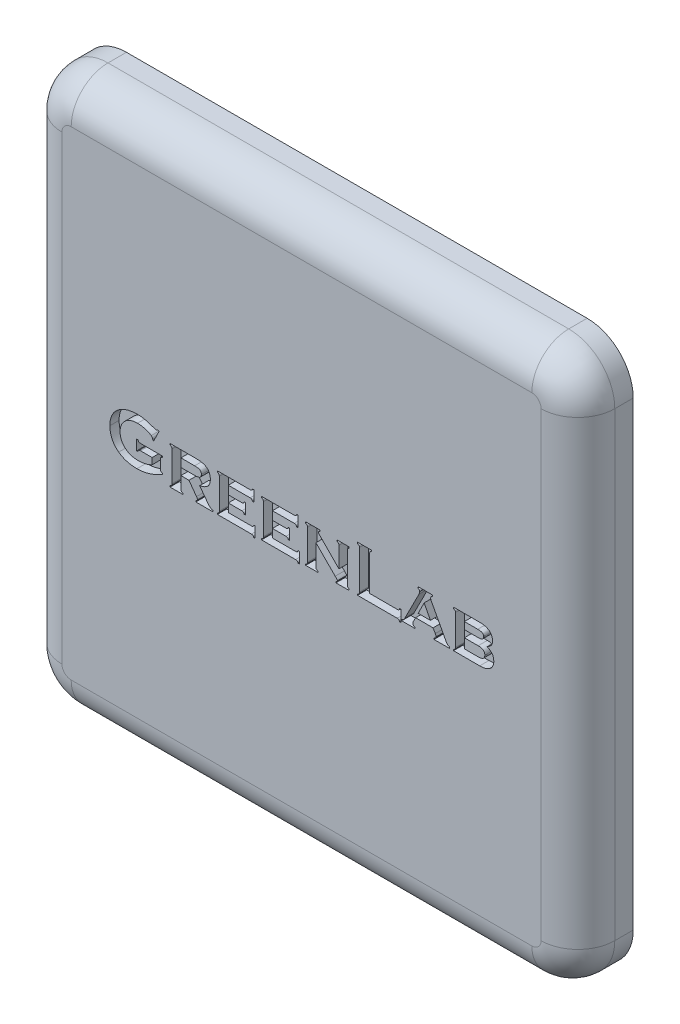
from build123d import *

# Parameters (mm, degrees)
SKETCH1_W           = 30.000000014
SKETCH1_H           = 30
BOSS_EXTRUDE1_DEPTH = 3
CUT_EXTRUDE1_START  = 1.500002
CUT_EXTRUDE1_DEPTH  = 0.5
BOSS_EXTRUDE2_START = 1.500028
BOSS_EXTRUDE2_DEPTH = 0.5
CUT_EXTRUDE2_START  = 1.500002
CUT_EXTRUDE2_DEPTH  = 0.5
BOSS_EXTRUDE3_START = 1.500028
BOSS_EXTRUDE3_DEPTH = 0.5
BOSS_EXTRUDE4_START = 1.500028
BOSS_EXTRUDE4_DEPTH = 0.5
CUT_EXTRUDE3_START  = 1.500002
CUT_EXTRUDE3_DEPTH  = 0.5
BOSS_EXTRUDE5_DEPTH = 0.5
CUT_EXTRUDE4_START  = 1.500002
CUT_EXTRUDE4_DEPTH  = 0.5
CUT_EXTRUDE5_START  = 1.500002
CUT_EXTRUDE5_DEPTH  = 0.5
CUT_EXTRUDE6_START  = 1.500002
CUT_EXTRUDE6_DEPTH  = 0.5
CUT_EXTRUDE7_START  = 1.500002
CUT_EXTRUDE7_DEPTH  = 0.5
CUT_EXTRUDE8_START  = 1.500002
CUT_EXTRUDE8_DEPTH  = 0.5
FILLET1_R           = 2.5
CHAMFER1_SIZE       = 0.091083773
CHAMFER1_SIZE2      = 0.082983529
FILLET2_R           = 2


with BuildPart() as part:
    # Sketch1 → Boss-Extrude1 (new body)
    with BuildSketch(Plane.XY.offset(3)):
        with Locations((-1.618e-06, -7.026e-06)):
            Rectangle(SKETCH1_W, SKETCH1_H)
    extrude(amount=-BOSS_EXTRUDE1_DEPTH)

    # Sketch2 → Cut-Extrude1 (cut)
    with BuildSketch(Plane.XY.offset(1.499998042).offset(CUT_EXTRUDE1_START)):
        with BuildLine():
            Line((-6.106229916, -0.416673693), (-6.545140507, -0.416673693))
            Line((-6.545140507, -0.416673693), (-6.545140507, -1.04818411))
            add(Edge.make_bspline(
                [(-6.545140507, -1.04818411), (-6.544473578, -1.060603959), (-6.543153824, -1.085181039), (-6.532801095, -1.121328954), (-6.507855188, -1.149496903), (-6.475690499, -1.16787463), (-6.452593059, -1.176316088), (-6.44097384, -1.180562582)],
                knots=[0, 0, 0, 0, 0.202843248, 0.401397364, 0.599300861, 0.798427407, 1, 1, 1, 1], degree=3))
            Line((-6.44097384, -1.180562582), (-6.44097384, -1.250007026))
            Line((-6.44097384, -1.250007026), (-7.135418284, -1.250007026))
            Line((-7.135418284, -1.250007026), (-7.135418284, -1.180562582))
            add(Edge.make_bspline(
                [(-7.135418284, -1.180562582), (-7.130522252, -1.178974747), (-7.120744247, -1.175803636), (-7.106322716, -1.170358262), (-7.092284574, -1.163918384), (-7.078939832, -1.156072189), (-7.066583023, -1.146684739), (-7.055763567, -1.135492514), (-7.047211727, -1.122492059), (-7.040637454, -1.108395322), (-7.036048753, -1.093589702), (-7.033207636, -1.078398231), (-7.03178077, -1.063051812), (-7.031428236, -1.052785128), (-7.031251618, -1.047641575)],
                knots=[0, 0, 0, 0, 0.083297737, 0.166356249, 0.249358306, 0.332965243, 0.416396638, 0.499814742, 0.583578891, 0.667019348, 0.750799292, 0.833751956, 0.916710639, 1, 1, 1, 1], degree=3))
            Line((-7.031251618, -1.047641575), (-7.031251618, 0.596238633))
            add(Edge.make_bspline(
                [(-7.031251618, 0.596238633), (-7.031467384, 0.600353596), (-7.031898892, 0.608583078), (-7.032933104, 0.620897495), (-7.034549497, 0.633124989), (-7.037009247, 0.645192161), (-7.040583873, 0.657001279), (-7.045537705, 0.6683115), (-7.052060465, 0.678837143), (-7.060155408, 0.688179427), (-7.06931687, 0.696458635), (-7.079323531, 0.703687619), (-7.08993715, 0.70999005), (-7.100985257, 0.715524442), (-7.112311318, 0.720451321), (-7.12380851, 0.72495007), (-7.13154719, 0.727756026), (-7.135418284, 0.72915964)],
                knots=[0, 0, 0, 0, 0.066822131, 0.133637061, 0.200355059, 0.266731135, 0.333141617, 0.400074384, 0.46641019, 0.533136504, 0.59984666, 0.666249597, 0.732989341, 0.799816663, 0.86650918, 0.933224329, 1, 1, 1, 1], degree=3))
            Line((-7.135418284, 0.72915964), (-7.135418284, 0.798604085))
            Line((-7.135418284, 0.798604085), (-5.805123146, 0.798604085))
            add(Edge.make_bspline(
                [(-5.805123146, 0.798604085), (-5.780616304, 0.798398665), (-5.731604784, 0.797987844), (-5.658099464, 0.79625398), (-5.584668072, 0.79279606), (-5.511415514, 0.786807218), (-5.438512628, 0.777768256), (-5.366729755, 0.763434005), (-5.296835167, 0.742622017), (-5.230115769, 0.713216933), (-5.18816938, 0.688797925), (-5.167102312, 0.676533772)],
                knots=[0, 0, 0, 0, 0.111579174, 0.2231485, 0.334733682, 0.44622071, 0.557706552, 0.669006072, 0.77912384, 0.889067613, 1, 1, 1, 1], degree=3))
            add(Edge.make_bspline(
                [(-5.167102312, 0.676533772), (-5.154763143, 0.66765202), (-5.130142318, 0.649929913), (-5.095666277, 0.620411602), (-5.064773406, 0.587391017), (-5.037991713, 0.550979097), (-5.014575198, 0.512301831), (-4.995017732, 0.471608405), (-4.979345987, 0.42947392), (-4.967058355, 0.38619193), (-4.957797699, 0.341995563), (-4.951967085, 0.297103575), (-4.949034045, 0.251930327), (-4.948290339, 0.221781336), (-4.947918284, 0.206698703)],
                knots=[0, 0, 0, 0, 0.084133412, 0.167874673, 0.250784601, 0.333836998, 0.417619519, 0.500718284, 0.583354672, 0.666147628, 0.749546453, 0.833074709, 0.916492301, 1, 1, 1, 1], degree=3))
            add(Edge.make_bspline(
                [(-4.947918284, 0.206698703), (-4.948580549, 0.186272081), (-4.94990496, 0.145422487), (-4.956712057, 0.084552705), (-4.968863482, 0.024592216), (-4.988036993, -0.033507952), (-5.014660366, -0.088462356), (-5.048214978, -0.139480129), (-5.08824372, -0.185602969), (-5.13444651, -0.225617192), (-5.184895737, -0.260069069), (-5.238383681, -0.289412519), (-5.293972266, -0.314301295), (-5.350882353, -0.335383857), (-5.408813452, -0.353220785), (-5.467509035, -0.368654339), (-5.50702161, -0.377515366), (-5.526802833, -0.381951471)],
                knots=[0, 0, 0, 0, 0.067093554, 0.134175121, 0.200873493, 0.267648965, 0.334524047, 0.400802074, 0.46761456, 0.53439703, 0.600932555, 0.66786926, 0.734464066, 0.800760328, 0.867034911, 0.933433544, 1, 1, 1, 1], degree=3))
            Line((-5.526802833, -0.381951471), (-5.129667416, -0.917433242))
            add(Edge.make_bspline(
                [(-5.129667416, -0.917433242), (-5.120118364, -0.930022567), (-5.101022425, -0.955198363), (-5.071770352, -0.992497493), (-5.041548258, -1.02901179), (-5.009934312, -1.064250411), (-4.976745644, -1.097946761), (-4.940268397, -1.128356), (-4.89926293, -1.152317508), (-4.855123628, -1.169942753), (-4.824422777, -1.177016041), (-4.809029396, -1.180562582)],
                knots=[0, 0, 0, 0, 0.111279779, 0.222534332, 0.333806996, 0.445027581, 0.555841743, 0.666724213, 0.778367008, 0.888873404, 1, 1, 1, 1], degree=3))
            Line((-4.809029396, -1.180562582), (-4.809029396, -1.250007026))
            Line((-4.809029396, -1.250007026), (-5.734051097, -1.250007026))
            Line((-5.734051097, -1.250007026), (-5.734051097, -1.180562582))
            add(Edge.make_bspline(
                [(-5.634767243, -1.101352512), (-5.635413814, -1.107068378), (-5.636702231, -1.118458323), (-5.64413306, -1.134429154), (-5.656852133, -1.146184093), (-5.670668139, -1.156288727), (-5.68567613, -1.164514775), (-5.701426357, -1.171013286), (-5.717639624, -1.176112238), (-5.728575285, -1.179077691), (-5.734051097, -1.180562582)],
                knots=[0, 0, 0, 0, 0.12593126, 0.250941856, 0.37645201, 0.501677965, 0.626962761, 0.751124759, 0.875380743, 1, 1, 1, 1], degree=3))
            add(Edge.make_bspline(
                [(-5.634767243, -1.101352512), (-5.635306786, -1.09758374), (-5.636383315, -1.090064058), (-5.639130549, -1.07903861), (-5.64269468, -1.068328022), (-5.647160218, -1.057983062), (-5.652606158, -1.048109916), (-5.658252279, -1.038321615), (-5.664206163, -1.028695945), (-5.670449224, -1.019251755), (-5.677004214, -1.010019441), (-5.683781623, -1.000946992), (-5.690705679, -0.991985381), (-5.695369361, -0.98604848), (-5.697701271, -0.983079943)],
                knots=[0, 0, 0, 0, 0.084082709, 0.167766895, 0.250652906, 0.333309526, 0.416319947, 0.499639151, 0.583018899, 0.666366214, 0.749761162, 0.833176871, 0.916585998, 1, 1, 1, 1], degree=3))
            Line((-5.697701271, -0.983079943), (-6.106229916, -0.416673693))
        make_face()
    extrude(amount=-CUT_EXTRUDE1_DEPTH, mode=Mode.SUBTRACT)

    # Sketch3 → Boss-Extrude2 (add)
    with BuildSketch(Plane.YX.offset(-4.000027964).offset(BOSS_EXTRUDE2_START)):
        with BuildLine():
            Line((0.41665964, -5.799697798), (0.41665964, -6.545140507))
            Line((0.41665964, -6.545140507), (-0.034729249, -6.545140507))
            Line((-0.034729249, -6.545140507), (-0.034729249, -5.799697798))
            add(Edge.make_bspline(
                [(-0.034729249, -5.799697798), (-0.034616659, -5.790245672), (-0.034391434, -5.771337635), (-0.033556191, -5.742985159), (-0.032101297, -5.714660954), (-0.029804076, -5.686388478), (-0.026462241, -5.658207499), (-0.022514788, -5.630104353), (-0.017106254, -5.602223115), (-0.00881011, -5.575071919), (-0.002219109, -5.557363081), (0.001078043, -5.548504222)],
                knots=[0, 0, 0, 0, 0.111096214, 0.222236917, 0.333344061, 0.444393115, 0.555543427, 0.666816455, 0.777923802, 0.88890622, 1, 1, 1, 1], degree=3))
            add(Edge.make_bspline(
                [(0.001078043, -5.548504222), (0.0061108, -5.538390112), (0.016141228, -5.518232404), (0.035981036, -5.490622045), (0.061759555, -5.468438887), (0.091459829, -5.452042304), (0.123658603, -5.441457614), (0.157052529, -5.43551634), (0.179643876, -5.434525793), (0.190965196, -5.434029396)],
                knots=[0, 0, 0, 0, 0.143264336, 0.285529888, 0.428089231, 0.571057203, 0.713277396, 0.856313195, 1, 1, 1, 1], degree=3))
            add(Edge.make_bspline(
                [(0.190965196, -5.434029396), (0.214569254, -5.435395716), (0.261502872, -5.438112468), (0.32888822, -5.464931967), (0.375464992, -5.52083735), (0.397961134, -5.588199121), (0.411028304, -5.657820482), (0.416265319, -5.728642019), (0.416528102, -5.775994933), (0.41665964, -5.799697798)],
                knots=[0, 0, 0, 0, 0.143321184, 0.284975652, 0.426217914, 0.569421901, 0.712368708, 0.856023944, 1, 1, 1, 1], degree=3))
        make_face()
    extrude(amount=-BOSS_EXTRUDE2_DEPTH)

    # Sketch4 → Cut-Extrude2 (cut)
    with BuildSketch(Plane.XY.offset(1.499998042).offset(CUT_EXTRUDE2_START)):
        with BuildLine():
            Line((9.670679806, -1.250007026), (8.24652616, -1.250007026))
            Line((8.24652616, -1.250007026), (8.24652616, -1.180562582))
            add(Edge.make_bspline(
                [(8.24652616, -1.180562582), (8.251422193, -1.178974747), (8.261200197, -1.175803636), (8.275621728, -1.170358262), (8.28965987, -1.163918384), (8.303004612, -1.156072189), (8.315361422, -1.146684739), (8.326180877, -1.135492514), (8.334732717, -1.122492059), (8.34130699, -1.108395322), (8.345895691, -1.093589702), (8.348736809, -1.078398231), (8.350163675, -1.063051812), (8.350516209, -1.052785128), (8.350692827, -1.047641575)],
                knots=[0, 0, 0, 0, 0.083297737, 0.166356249, 0.249358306, 0.332965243, 0.416396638, 0.499814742, 0.583578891, 0.667019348, 0.750799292, 0.833751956, 0.916710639, 1, 1, 1, 1], degree=3))
            Line((8.350692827, -1.047641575), (8.350692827, 0.596238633))
            add(Edge.make_bspline(
                [(8.350692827, 0.596238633), (8.349982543, 0.608502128), (8.348574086, 0.632820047), (8.338878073, 0.668917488), (8.314230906, 0.69762551), (8.281675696, 0.716208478), (8.258296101, 0.7248229), (8.24652616, 0.72915964)],
                knots=[0, 0, 0, 0, 0.199879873, 0.396352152, 0.595025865, 0.796124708, 1, 1, 1, 1], degree=3))
            Line((8.24652616, 0.72915964), (8.24652616, 0.798604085))
            Line((8.24652616, 0.798604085), (9.644095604, 0.798604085))
            add(Edge.make_bspline(
                [(9.644095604, 0.798604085), (9.671083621, 0.79807869), (9.725041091, 0.797028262), (9.805785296, 0.791621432), (9.886028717, 0.78168197), (9.965359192, 0.765710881), (10.042269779, 0.741216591), (10.116327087, 0.708558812), (10.160631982, 0.678188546), (10.182832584, 0.662970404)],
                knots=[0, 0, 0, 0, 0.14329605, 0.286493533, 0.429411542, 0.572336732, 0.715373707, 0.8573775, 1, 1, 1, 1], degree=3))
            add(Edge.make_bspline(
                [(10.182832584, 0.662970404), (10.195562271, 0.652165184), (10.2210203, 0.630555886), (10.255977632, 0.594603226), (10.285772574, 0.554483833), (10.311146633, 0.511566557), (10.331826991, 0.466181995), (10.346757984, 0.418663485), (10.356726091, 0.370070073), (10.36273618, 0.320860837), (10.36396532, 0.287826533), (10.364581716, 0.271260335)],
                knots=[0, 0, 0, 0, 0.11182405, 0.223636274, 0.335033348, 0.445742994, 0.557092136, 0.668347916, 0.778631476, 0.888987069, 1, 1, 1, 1], degree=3))
            add(Edge.make_bspline(
                [(10.364581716, 0.271260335), (10.363540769, 0.245367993), (10.361459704, 0.193603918), (10.344821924, 0.117403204), (10.312778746, 0.04597875), (10.263871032, -0.014964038), (10.205382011, -0.066361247), (10.141146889, -0.110402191), (10.096272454, -0.136611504), (10.073783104, -0.14974661)],
                knots=[0, 0, 0, 0, 0.142850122, 0.285586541, 0.42774764, 0.570823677, 0.713189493, 0.856261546, 1, 1, 1, 1], degree=3))
            add(Edge.make_bspline(
                [(10.073783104, -0.14974661), (10.08261312, -0.153925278), (10.100270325, -0.162281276), (10.126580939, -0.1751736), (10.152636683, -0.188573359), (10.178326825, -0.202686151), (10.203522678, -0.217682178), (10.227974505, -0.233882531), (10.251669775, -0.251155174), (10.274675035, -0.269352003), (10.289401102, -0.282207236), (10.296764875, -0.288635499)],
                knots=[0, 0, 0, 0, 0.111096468, 0.222157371, 0.333196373, 0.444276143, 0.555455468, 0.666550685, 0.777717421, 0.888847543, 1, 1, 1, 1], degree=3))
            add(Edge.make_bspline(
                [(10.296764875, -0.288635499), (10.306821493, -0.299119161), (10.326895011, -0.320045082), (10.354038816, -0.354237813), (10.376527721, -0.391586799), (10.395605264, -0.430654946), (10.410283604, -0.471439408), (10.420963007, -0.513457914), (10.428150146, -0.556371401), (10.432528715, -0.599814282), (10.433526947, -0.628905), (10.43402616, -0.643453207)],
                knots=[0, 0, 0, 0, 0.111353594, 0.222267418, 0.333844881, 0.444931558, 0.55511502, 0.665519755, 0.776881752, 0.88841903, 1, 1, 1, 1], degree=3))
            add(Edge.make_bspline(
                [(10.43402616, -0.643453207), (10.43343277, -0.663162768), (10.43224984, -0.702454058), (10.425947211, -0.761136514), (10.413178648, -0.818817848), (10.39460022, -0.875097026), (10.369704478, -0.929004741), (10.338767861, -0.979775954), (10.301936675, -1.026590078), (10.25924822, -1.068396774), (10.228206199, -1.093253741), (10.212671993, -1.10569279)],
                knots=[0, 0, 0, 0, 0.110911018, 0.221102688, 0.331445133, 0.442621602, 0.553891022, 0.66473059, 0.776355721, 0.888082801, 1, 1, 1, 1], degree=3))
            add(Edge.make_bspline(
                [(10.212671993, -1.10569279), (10.189966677, -1.12053216), (10.144717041, -1.15010568), (10.071154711, -1.184905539), (9.99400232, -1.210563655), (9.914783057, -1.230034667), (9.833929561, -1.241971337), (9.752439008, -1.248378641), (9.697942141, -1.249464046), (9.670679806, -1.250007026)],
                knots=[0, 0, 0, 0, 0.142651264, 0.284291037, 0.426813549, 0.570029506, 0.713136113, 0.856494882, 1, 1, 1, 1], degree=3))
        make_face()
    extrude(amount=-CUT_EXTRUDE2_DEPTH, mode=Mode.SUBTRACT)

    # Sketch5 → Boss-Extrude3 (add)
    with BuildSketch(Plane.YX.offset(-4.000027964).offset(BOSS_EXTRUDE3_START)):
        with BuildLine():
            Line((-0.347229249, 9.585501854), (-0.347229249, 8.836803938))
            Line((-0.347229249, 8.836803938), (-0.868062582, 8.836803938))
            Line((-0.868062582, 8.836803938), (-0.868062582, 9.585501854))
            add(Edge.make_bspline(
                [(-0.868062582, 9.585501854), (-0.867187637, 9.609822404), (-0.86544169, 9.658353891), (-0.85627901, 9.730513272), (-0.836492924, 9.800535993), (-0.80192361, 9.865044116), (-0.748130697, 9.915460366), (-0.679812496, 9.943181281), (-0.63175628, 9.946333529), (-0.607645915, 9.947915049)],
                knots=[0, 0, 0, 0, 0.144144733, 0.287639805, 0.429843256, 0.57314838, 0.715839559, 0.857433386, 1, 1, 1, 1], degree=3))
            add(Edge.make_bspline(
                [(-0.607645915, 9.947915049), (-0.592209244, 9.947386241), (-0.561339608, 9.946328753), (-0.515890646, 9.935911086), (-0.473518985, 9.916448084), (-0.436736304, 9.88770778), (-0.406928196, 9.852007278), (-0.384480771, 9.811357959), (-0.368874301, 9.7677753), (-0.358227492, 9.722894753), (-0.351234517, 9.677389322), (-0.348175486, 9.631510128), (-0.347545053, 9.600857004), (-0.347229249, 9.585501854)],
                knots=[0, 0, 0, 0, 0.091138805, 0.182255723, 0.273529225, 0.364502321, 0.45574615, 0.546554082, 0.637472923, 0.728490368, 0.818807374, 0.909234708, 1, 1, 1, 1], degree=3))
        make_face()
    extrude(amount=-BOSS_EXTRUDE3_DEPTH)

    # Sketch6 → Boss-Extrude4 (add)
    with BuildSketch(Plane.YX.offset(-4.000027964).offset(BOSS_EXTRUDE4_START)):
        with BuildLine():
            Line((0.41665964, 9.563800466), (0.41665964, 8.836803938))
            Line((0.41665964, 8.836803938), (0.034715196, 8.836803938))
            Line((0.034715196, 8.836803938), (0.034715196, 9.563800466))
            add(Edge.make_bspline(
                [(0.034715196, 9.563800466), (0.035023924, 9.584081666), (0.035640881, 9.624611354), (0.039747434, 9.68515854), (0.050650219, 9.744763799), (0.071035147, 9.802005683), (0.110036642, 9.850223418), (0.16698098, 9.874539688), (0.206795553, 9.877157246), (0.226772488, 9.878470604)],
                knots=[0, 0, 0, 0, 0.144279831, 0.288326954, 0.431110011, 0.574240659, 0.716996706, 0.858003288, 1, 1, 1, 1], degree=3))
            add(Edge.make_bspline(
                [(0.226772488, 9.878470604), (0.246972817, 9.877155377), (0.286981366, 9.874550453), (0.343679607, 9.849290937), (0.381051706, 9.800286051), (0.400777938, 9.743380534), (0.411523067, 9.684151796), (0.415657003, 9.624094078), (0.416325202, 9.583911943), (0.41665964, 9.563800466)],
                knots=[0, 0, 0, 0, 0.144138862, 0.285479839, 0.427396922, 0.570467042, 0.712917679, 0.856313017, 1, 1, 1, 1], degree=3))
        make_face()
    extrude(amount=-BOSS_EXTRUDE4_DEPTH)

    # Sketch7 → Cut-Extrude3 (cut)
    with BuildSketch(Plane.XY.offset(1.499998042).offset(CUT_EXTRUDE3_START)):
        with BuildLine():
            Line((7.258570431, -0.934251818), (7.139755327, -0.729173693))
            Line((7.139755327, -0.729173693), (6.189777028, -0.729173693))
            Line((6.189777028, -0.729173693), (6.076387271, -0.947815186))
            add(Edge.make_bspline(
                [(6.076387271, -0.947815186), (6.074331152, -0.952201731), (6.070219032, -0.960974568), (6.064206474, -0.974204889), (6.058535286, -0.987585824), (6.053329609, -1.001134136), (6.048520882, -1.014806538), (6.044495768, -1.028717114), (6.041312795, -1.042834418), (6.038955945, -1.057111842), (6.038229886, -1.066716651), (6.037867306, -1.071513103)],
                knots=[0, 0, 0, 0, 0.111432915, 0.22285944, 0.334256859, 0.445661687, 0.556664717, 0.667537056, 0.77853269, 0.889403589, 1, 1, 1, 1], degree=3))
            add(Edge.make_bspline(
                [(6.037867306, -1.071513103), (6.038564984, -1.080205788), (6.039949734, -1.097459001), (6.049842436, -1.122053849), (6.067679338, -1.141173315), (6.088510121, -1.156727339), (6.112379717, -1.167436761), (6.137488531, -1.174876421), (6.154616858, -1.178665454), (6.163192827, -1.180562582)],
                knots=[0, 0, 0, 0, 0.143336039, 0.284492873, 0.426758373, 0.56877159, 0.710871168, 0.855236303, 1, 1, 1, 1], degree=3))
            Line((6.163192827, -1.180562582), (6.163192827, -1.250007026))
            Line((6.163192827, -1.250007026), (5.43402616, -1.250007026))
            Line((5.43402616, -1.250007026), (5.43402616, -1.180562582))
            add(Edge.make_bspline(
                [(5.43402616, -1.180562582), (5.450984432, -1.177139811), (5.484582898, -1.170358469), (5.532341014, -1.148280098), (5.566950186, -1.108967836), (5.594377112, -1.065041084), (5.610440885, -1.034291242), (5.618487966, -1.018887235)],
                knots=[0, 0, 0, 0, 0.200923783, 0.398078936, 0.597330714, 0.798284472, 1, 1, 1, 1], degree=3))
            Line((5.618487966, -1.018887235), (6.372611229, 0.46711537))
            add(Edge.make_bspline(
                [(6.372611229, 0.46711537), (6.377011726, 0.476456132), (6.385808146, 0.49512795), (6.397788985, 0.523669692), (6.407209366, 0.553107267), (6.412646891, 0.583487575), (6.414167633, 0.603915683), (6.414928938, 0.614142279)],
                knots=[0, 0, 0, 0, 0.200817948, 0.401427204, 0.601706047, 0.800608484, 1, 1, 1, 1], degree=3))
            add(Edge.make_bspline(
                [(6.414928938, 0.614142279), (6.414423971, 0.618682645), (6.413414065, 0.627763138), (6.410977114, 0.64123307), (6.4067198, 0.654288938), (6.40009594, 0.666335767), (6.391898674, 0.677371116), (6.382426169, 0.687325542), (6.371959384, 0.696196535), (6.360740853, 0.70410193), (6.348968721, 0.711177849), (6.336795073, 0.71755478), (6.324380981, 0.723472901), (6.316025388, 0.727263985), (6.311847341, 0.72915964)],
                knots=[0, 0, 0, 0, 0.083293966, 0.166583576, 0.249220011, 0.332436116, 0.416064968, 0.499280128, 0.582425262, 0.665850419, 0.749260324, 0.832693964, 0.916341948, 1, 1, 1, 1], degree=3))
            Line((6.311847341, 0.72915964), (6.311847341, 0.798604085))
            Line((6.311847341, 0.798604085), (7.109373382, 0.798604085))
            Line((7.109373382, 0.798604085), (7.109373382, 0.72915964))
            add(Edge.make_bspline(
                [(7.109373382, 0.72915964), (7.10505096, 0.727268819), (7.096405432, 0.723486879), (7.083603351, 0.717459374), (7.071168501, 0.710749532), (7.059374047, 0.702986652), (7.048420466, 0.694099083), (7.038390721, 0.684184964), (7.029415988, 0.673284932), (7.021712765, 0.66144765), (7.015636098, 0.648680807), (7.011848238, 0.635071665), (7.009748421, 0.621136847), (7.008890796, 0.611772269), (7.008461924, 0.607089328)],
                knots=[0, 0, 0, 0, 0.083653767, 0.167320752, 0.250841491, 0.333978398, 0.417297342, 0.500544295, 0.583634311, 0.667176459, 0.750413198, 0.833266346, 0.916621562, 1, 1, 1, 1], degree=3))
            add(Edge.make_bspline(
                [(7.008461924, 0.607089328), (7.008758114, 0.601397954), (7.009350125, 0.590022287), (7.011290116, 0.573015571), (7.015202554, 0.556341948), (7.020207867, 0.539988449), (7.025677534, 0.52379243), (7.03195138, 0.507904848), (7.038865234, 0.492290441), (7.046252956, 0.476890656), (7.051441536, 0.466755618), (7.054034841, 0.461690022)],
                knots=[0, 0, 0, 0, 0.111191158, 0.222243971, 0.33339132, 0.4447422, 0.55587121, 0.666815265, 0.77786568, 0.888975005, 1, 1, 1, 1], degree=3))
            Line((7.054034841, 0.461690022), (7.826604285, -0.9792822))
            add(Edge.make_bspline(
                [(7.826604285, -0.9792822), (7.833695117, -0.992066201), (7.847875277, -1.017631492), (7.869784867, -1.055589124), (7.893751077, -1.092182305), (7.920284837, -1.127034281), (7.954877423, -1.154505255), (7.995719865, -1.170702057), (8.023998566, -1.177267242), (8.038192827, -1.180562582)],
                knots=[0, 0, 0, 0, 0.143479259, 0.2869281, 0.429931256, 0.572815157, 0.715088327, 0.85699094, 1, 1, 1, 1], degree=3))
            Line((8.038192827, -1.180562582), (8.038192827, -1.250007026))
            Line((8.038192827, -1.250007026), (7.187498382, -1.250007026))
            Line((7.187498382, -1.250007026), (7.187498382, -1.180562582))
            add(Edge.make_bspline(
                [(7.187498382, -1.180562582), (7.195791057, -1.178889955), (7.212343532, -1.175551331), (7.23649266, -1.1680733), (7.259264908, -1.157092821), (7.279166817, -1.141459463), (7.294693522, -1.121201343), (7.303115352, -1.096901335), (7.304161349, -1.079992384), (7.304685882, -1.071513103)],
                knots=[0, 0, 0, 0, 0.143671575, 0.286773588, 0.428416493, 0.570748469, 0.71294618, 0.856051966, 1, 1, 1, 1], degree=3))
            add(Edge.make_bspline(
                [(7.304685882, -1.071513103), (7.304366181, -1.066101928), (7.30372719, -1.05528653), (7.301741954, -1.039128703), (7.297848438, -1.023312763), (7.292804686, -1.007847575), (7.287099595, -0.992619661), (7.280662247, -0.977698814), (7.273655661, -0.963038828), (7.266250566, -0.94857228), (7.261129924, -0.939024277), (7.258570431, -0.934251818)],
                knots=[0, 0, 0, 0, 0.11117783, 0.222212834, 0.33330829, 0.444614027, 0.555734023, 0.666710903, 0.777788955, 0.888930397, 1, 1, 1, 1], degree=3))
        make_face()
    extrude(amount=-CUT_EXTRUDE3_DEPTH, mode=Mode.SUBTRACT)

    # Sketch8 → Boss-Extrude5 (add)
    with BuildSketch(Plane.XY.offset(2.5)):
        Polygon((6.329208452, -0.451395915), (6.655814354, 0.203986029), (6.994356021, -0.451395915), align=None)
    extrude(amount=BOSS_EXTRUDE5_DEPTH)

    # Sketch9 → Cut-Extrude4 (cut)
    with BuildSketch(Plane.XY.offset(1.499998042).offset(CUT_EXTRUDE4_START)):
        with BuildLine():
            Line((-8.107640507, -0.689568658), (-8.107640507, -0.347229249))
            Line((-8.107640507, -0.347229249), (-8.736980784, -0.347229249))
            add(Edge.make_bspline(
                [(-8.736980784, -0.347229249), (-8.74114811, -0.347427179), (-8.749481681, -0.34782299), (-8.761962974, -0.348762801), (-8.774370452, -0.350261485), (-8.786627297, -0.352580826), (-8.79863935, -0.355994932), (-8.81018808, -0.360777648), (-8.820984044, -0.36713035), (-8.830648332, -0.375089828), (-8.839163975, -0.38423675), (-8.846541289, -0.394319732), (-8.852894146, -0.405068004), (-8.858394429, -0.41629378), (-8.863215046, -0.427830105), (-8.867547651, -0.439549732), (-8.870201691, -0.447445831), (-8.871529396, -0.451395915)],
                knots=[0, 0, 0, 0, 0.06684042, 0.133663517, 0.200491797, 0.266970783, 0.333321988, 0.40021623, 0.466699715, 0.533229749, 0.600076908, 0.666418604, 0.733001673, 0.799857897, 0.866542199, 0.933236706, 1, 1, 1, 1], degree=3))
            Line((-8.871529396, -0.451395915), (-8.94097384, -0.451395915))
            Line((-8.94097384, -0.451395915), (-8.94097384, 0.10415964))
            Line((-8.94097384, 0.10415964), (-8.871529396, 0.10415964))
            add(Edge.make_bspline(
                [(-8.871529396, 0.10415964), (-8.870262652, 0.100229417), (-8.867729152, 0.092368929), (-8.863615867, 0.080691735), (-8.85904784, 0.069209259), (-8.853831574, 0.058028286), (-8.847763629, 0.047259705), (-8.840662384, 0.037117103), (-8.83239499, 0.027879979), (-8.822944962, 0.019817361), (-8.812270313, 0.013457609), (-8.800790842, 0.008688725), (-8.788857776, 0.005301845), (-8.77667435, 0.003000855), (-8.764391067, 0.001512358), (-8.752056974, 0.000574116), (-8.743816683, 0.000186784), (-8.739693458, -7.026e-06)],
                knots=[0, 0, 0, 0, 0.066767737, 0.133536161, 0.200149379, 0.266511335, 0.332885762, 0.399769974, 0.466305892, 0.532830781, 0.599818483, 0.666326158, 0.73328662, 0.80003125, 0.86661451, 0.933257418, 1, 1, 1, 1], degree=3))
            Line((-8.739693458, -7.026e-06), (-7.552084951, -7.026e-06))
            Line((-7.552084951, -7.026e-06), (-7.552084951, -0.069451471))
            add(Edge.make_bspline(
                [(-7.552084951, -0.069451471), (-7.555863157, -0.070663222), (-7.563417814, -0.073086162), (-7.574618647, -0.077070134), (-7.585629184, -0.081489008), (-7.596363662, -0.086504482), (-7.606742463, -0.092276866), (-7.616602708, -0.098944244), (-7.625728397, -0.106602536), (-7.63394413, -0.115274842), (-7.640626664, -0.125182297), (-7.645864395, -0.135924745), (-7.649784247, -0.147191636), (-7.652600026, -0.15877519), (-7.654502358, -0.170517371), (-7.655715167, -0.182346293), (-7.656072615, -0.190267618), (-7.656251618, -0.194234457)],
                knots=[0, 0, 0, 0, 0.066745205, 0.133459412, 0.199945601, 0.266258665, 0.332646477, 0.399532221, 0.466171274, 0.532717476, 0.599800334, 0.666338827, 0.733243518, 0.800088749, 0.866627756, 0.933209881, 1, 1, 1, 1], degree=3))
            Line((-7.656251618, -0.194234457), (-7.656251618, -0.673835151))
            add(Edge.make_bspline(
                [(-7.656251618, -0.673835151), (-7.655989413, -0.679651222), (-7.65546551, -0.691272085), (-7.653597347, -0.708664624), (-7.649637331, -0.725730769), (-7.642884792, -0.741952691), (-7.632907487, -0.756447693), (-7.619851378, -0.768230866), (-7.605040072, -0.777512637), (-7.589439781, -0.785393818), (-7.573206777, -0.791921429), (-7.556534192, -0.797282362), (-7.539790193, -0.802407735), (-7.523063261, -0.807591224), (-7.506331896, -0.812759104), (-7.489601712, -0.817931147), (-7.478448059, -0.821378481), (-7.472871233, -0.823102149)],
                knots=[0, 0, 0, 0, 0.066614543, 0.133099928, 0.199888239, 0.266383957, 0.333004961, 0.399459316, 0.466085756, 0.53250076, 0.599246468, 0.666044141, 0.732835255, 0.799626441, 0.866417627, 0.933208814, 1, 1, 1, 1], degree=3))
            add(Edge.make_bspline(
                [(-7.472871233, -0.823102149), (-7.52262081, -0.851524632), (-7.622046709, -0.908327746), (-7.773036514, -0.990135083), (-7.928732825, -1.062592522), (-8.088164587, -1.127030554), (-8.251349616, -1.182107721), (-8.417952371, -1.226739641), (-8.587150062, -1.259589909), (-8.758393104, -1.280741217), (-8.873226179, -1.28339955), (-8.93066568, -1.284729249)],
                knots=[0, 0, 0, 0, 0.111027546, 0.221891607, 0.332641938, 0.443598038, 0.55495368, 0.666166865, 0.777542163, 0.888726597, 1, 1, 1, 1], degree=3))
            add(Edge.make_bspline(
                [(-8.93066568, -1.284729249), (-8.969479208, -1.283972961), (-9.047085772, -1.282460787), (-9.163339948, -1.274662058), (-9.27861921, -1.259228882), (-9.392532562, -1.237275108), (-9.504369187, -1.207341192), (-9.614093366, -1.169615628), (-9.720690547, -1.122723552), (-9.822281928, -1.065105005), (-9.886499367, -1.021278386), (-9.918621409, -0.999355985)],
                knots=[0, 0, 0, 0, 0.111320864, 0.222582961, 0.333916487, 0.444649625, 0.555042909, 0.665639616, 0.777094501, 0.888501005, 1, 1, 1, 1], degree=3))
            add(Edge.make_bspline(
                [(-9.918621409, -0.999355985), (-9.952159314, -0.972327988), (-10.019225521, -0.918279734), (-10.110808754, -0.82697202), (-10.190502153, -0.725725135), (-10.257742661, -0.616034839), (-10.312004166, -0.499541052), (-10.353114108, -0.378069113), (-10.380794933, -0.253407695), (-10.396100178, -0.126694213), (-10.398235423, -0.041622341), (-10.399307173, 0.001078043)],
                knots=[0, 0, 0, 0, 0.111932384, 0.22383272, 0.335372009, 0.446128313, 0.557575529, 0.668779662, 0.778850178, 0.888997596, 1, 1, 1, 1], degree=3))
            add(Edge.make_bspline(
                [(-10.399307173, 0.001078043), (-10.398427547, 0.031127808), (-10.396671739, 0.09110966), (-10.389797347, 0.18074173), (-10.376722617, 0.269532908), (-10.35669672, 0.357130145), (-10.330712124, 0.443243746), (-10.298053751, 0.526945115), (-10.258736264, 0.607425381), (-10.21285144, 0.684406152), (-10.161125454, 0.757937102), (-10.102673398, 0.82648744), (-10.038952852, 0.89011063), (-9.994191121, 0.930005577), (-9.971789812, 0.949971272)],
                knots=[0, 0, 0, 0, 0.083684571, 0.167041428, 0.250102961, 0.333281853, 0.416969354, 0.500290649, 0.583123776, 0.66602595, 0.749531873, 0.833096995, 0.916472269, 1, 1, 1, 1], degree=3))
            add(Edge.make_bspline(
                [(-9.971789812, 0.949971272), (-9.946416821, 0.969883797), (-9.895913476, 1.009518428), (-9.815867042, 1.062567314), (-9.732072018, 1.108165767), (-9.645845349, 1.148533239), (-9.556859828, 1.183254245), (-9.465461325, 1.212377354), (-9.372195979, 1.235925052), (-9.27773107, 1.25443043), (-9.182506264, 1.268523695), (-9.086660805, 1.277700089), (-8.990526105, 1.282599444), (-8.926391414, 1.284009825), (-8.894315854, 1.284715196)],
                knots=[0, 0, 0, 0, 0.0840177, 0.167231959, 0.249841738, 0.332365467, 0.415152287, 0.498538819, 0.582143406, 0.665641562, 0.749251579, 0.832857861, 0.916407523, 1, 1, 1, 1], degree=3))
            add(Edge.make_bspline(
                [(-8.894315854, 1.284715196), (-8.86264089, 1.284084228), (-8.799356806, 1.282823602), (-8.704583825, 1.277479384), (-8.610314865, 1.266587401), (-8.516585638, 1.250902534), (-8.42367809, 1.23012924), (-8.331748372, 1.204969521), (-8.240848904, 1.176312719), (-8.150792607, 1.145063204), (-8.091281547, 1.122785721), (-8.061525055, 1.11164662)],
                knots=[0, 0, 0, 0, 0.111023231, 0.221815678, 0.332506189, 0.443406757, 0.554706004, 0.665982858, 0.777317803, 0.888655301, 1, 1, 1, 1], degree=3))
            add(Edge.make_bspline(
                [(-8.061525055, 1.11164662), (-8.055158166, 1.109169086), (-8.042425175, 1.104214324), (-8.023277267, 1.096910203), (-8.004029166, 1.089873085), (-7.984632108, 1.083241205), (-7.965051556, 1.077165), (-7.945260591, 1.071788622), (-7.925257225, 1.067305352), (-7.905055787, 1.063753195), (-7.891458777, 1.062406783), (-7.884658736, 1.061733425)],
                knots=[0, 0, 0, 0, 0.111113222, 0.222212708, 0.333299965, 0.444409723, 0.555576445, 0.666682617, 0.777848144, 0.888898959, 1, 1, 1, 1], degree=3))
            add(Edge.make_bspline(
                [(-7.795140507, 1.104051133), (-7.798459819, 1.101464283), (-7.805098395, 1.096290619), (-7.815246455, 1.088782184), (-7.825773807, 1.081809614), (-7.836732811, 1.075583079), (-7.847971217, 1.069942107), (-7.859853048, 1.065863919), (-7.872122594, 1.063103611), (-7.880468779, 1.062191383), (-7.884658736, 1.061733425)],
                knots=[0, 0, 0, 0, 0.125374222, 0.250746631, 0.376020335, 0.501268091, 0.626155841, 0.750016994, 0.874503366, 1, 1, 1, 1], degree=3))
            Line((-7.795140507, 1.104051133), (-7.725696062, 1.076381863))
            Line((-7.725696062, 1.076381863), (-8.020834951, 0.477423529))
            Line((-8.020834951, 0.477423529), (-8.074003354, 0.505635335))
            add(Edge.make_bspline(
                [(-8.074003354, 0.505635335), (-8.07419637, 0.510794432), (-8.074582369, 0.521111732), (-8.075811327, 0.536537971), (-8.078098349, 0.55181074), (-8.080978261, 0.566949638), (-8.084889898, 0.581931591), (-8.091428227, 0.59601344), (-8.100238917, 0.608740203), (-8.110249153, 0.620492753), (-8.121278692, 0.63132498), (-8.132922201, 0.641478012), (-8.144921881, 0.651192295), (-8.152980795, 0.657597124), (-8.157011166, 0.660800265)],
                knots=[0, 0, 0, 0, 0.083588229, 0.167161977, 0.250398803, 0.333468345, 0.416700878, 0.500406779, 0.583278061, 0.666596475, 0.750048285, 0.833325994, 0.916644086, 1, 1, 1, 1], degree=3))
            add(Edge.make_bspline(
                [(-8.157011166, 0.660800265), (-8.181250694, 0.676716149), (-8.229486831, 0.708388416), (-8.306914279, 0.747136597), (-8.387748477, 0.777183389), (-8.470140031, 0.803235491), (-8.553894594, 0.825528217), (-8.638788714, 0.843624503), (-8.724449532, 0.857576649), (-8.810904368, 0.865368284), (-8.868678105, 0.867154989), (-8.897571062, 0.868048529)],
                knots=[0, 0, 0, 0, 0.111591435, 0.222064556, 0.332465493, 0.443340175, 0.5547237, 0.66604905, 0.77745797, 0.888705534, 1, 1, 1, 1], degree=3))
            add(Edge.make_bspline(
                [(-8.897571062, 0.868048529), (-8.923702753, 0.867457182), (-8.975930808, 0.866275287), (-9.054119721, 0.859978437), (-9.131445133, 0.847360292), (-9.207520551, 0.82962287), (-9.28177052, 0.806044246), (-9.35368567, 0.776061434), (-9.423201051, 0.74025631), (-9.489035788, 0.697415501), (-9.530188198, 0.665057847), (-9.550782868, 0.648864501)],
                knots=[0, 0, 0, 0, 0.111420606, 0.222690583, 0.334079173, 0.445106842, 0.555443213, 0.66577585, 0.776892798, 0.888346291, 1, 1, 1, 1], degree=3))
            add(Edge.make_bspline(
                [(-9.550782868, 0.648864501), (-9.571349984, 0.630089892), (-9.612396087, 0.59262112), (-9.668332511, 0.531019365), (-9.716246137, 0.463455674), (-9.757508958, 0.391679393), (-9.790551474, 0.315780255), (-9.814864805, 0.237017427), (-9.832212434, 0.156871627), (-9.841235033, 0.075219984), (-9.842910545, 0.020438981), (-9.843751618, -0.007059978)],
                knots=[0, 0, 0, 0, 0.112436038, 0.224390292, 0.335258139, 0.446301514, 0.558217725, 0.668795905, 0.778699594, 0.888911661, 1, 1, 1, 1], degree=3))
            add(Edge.make_bspline(
                [(-9.843751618, -0.007059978), (-9.842903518, -0.033852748), (-9.841211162, -0.087316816), (-9.832336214, -0.167169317), (-9.815215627, -0.245755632), (-9.790932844, -0.322421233), (-9.758461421, -0.395932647), (-9.718488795, -0.465582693), (-9.671646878, -0.531048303), (-9.61733315, -0.590771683), (-9.577676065, -0.626970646), (-9.557835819, -0.645080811)],
                knots=[0, 0, 0, 0, 0.111227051, 0.221949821, 0.33287863, 0.444491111, 0.555145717, 0.665712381, 0.777227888, 0.8885482, 1, 1, 1, 1], degree=3))
            add(Edge.make_bspline(
                [(-9.557835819, -0.645080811), (-9.536184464, -0.662034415), (-9.492901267, -0.695926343), (-9.423512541, -0.740802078), (-9.349590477, -0.777042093), (-9.273347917, -0.807050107), (-9.195123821, -0.83066717), (-9.115004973, -0.847813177), (-9.033549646, -0.859235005), (-8.951313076, -0.86602107), (-8.896318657, -0.867382), (-8.868816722, -0.868062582)],
                knots=[0, 0, 0, 0, 0.11152034, 0.222940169, 0.334443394, 0.444883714, 0.554993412, 0.665496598, 0.776889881, 0.888425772, 1, 1, 1, 1], degree=3))
            add(Edge.make_bspline(
                [(-8.868816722, -0.868062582), (-8.839575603, -0.86735519), (-8.78115793, -0.865941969), (-8.693696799, -0.860372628), (-8.606769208, -0.849461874), (-8.52038064, -0.834356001), (-8.434614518, -0.81546697), (-8.349864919, -0.792130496), (-8.266515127, -0.76427619), (-8.185720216, -0.729652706), (-8.133672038, -0.702932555), (-8.107640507, -0.689568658)],
                knots=[0, 0, 0, 0, 0.111138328, 0.222031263, 0.332834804, 0.443847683, 0.55517047, 0.666400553, 0.777726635, 0.888831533, 1, 1, 1, 1], degree=3))
        make_face()
    extrude(amount=-CUT_EXTRUDE4_DEPTH, mode=Mode.SUBTRACT)

    # Sketch10 → Cut-Extrude5 (cut)
    with BuildSketch(Plane.XY.offset(1.499998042).offset(CUT_EXTRUDE5_START)):
        with BuildLine():
            Line((-3.238391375, -0.416673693), (-3.975696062, -0.416673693))
            Line((-3.975696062, -0.416673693), (-3.975696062, -0.868062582))
            Line((-3.975696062, -0.868062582), (-2.717558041, -0.868062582))
            add(Edge.make_bspline(
                [(-2.717558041, -0.868062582), (-2.713457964, -0.86788746), (-2.705258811, -0.86753726), (-2.69297771, -0.866679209), (-2.680782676, -0.865179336), (-2.668762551, -0.862733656), (-2.657063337, -0.859001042), (-2.645886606, -0.853897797), (-2.63549918, -0.847295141), (-2.626140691, -0.839326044), (-2.617906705, -0.830211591), (-2.610918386, -0.82013138), (-2.604840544, -0.809491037), (-2.59956256, -0.79841092), (-2.594910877, -0.787052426), (-2.590732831, -0.775519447), (-2.588116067, -0.767771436), (-2.586807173, -0.763895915)],
                knots=[0, 0, 0, 0, 0.066920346, 0.133824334, 0.200704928, 0.267150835, 0.333552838, 0.400526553, 0.466950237, 0.53359553, 0.600371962, 0.666655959, 0.733214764, 0.800004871, 0.86664252, 0.933295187, 1, 1, 1, 1], degree=3))
            Line((-2.586807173, -0.763895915), (-2.517362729, -0.763895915))
            Line((-2.517362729, -0.763895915), (-2.517362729, -1.354173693))
            Line((-2.517362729, -1.354173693), (-2.586807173, -1.354173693))
            add(Edge.make_bspline(
                [(-2.586807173, -1.354173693), (-2.587991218, -1.350246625), (-2.590356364, -1.342402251), (-2.594426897, -1.330823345), (-2.59905847, -1.319486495), (-2.604438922, -1.308476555), (-2.61072634, -1.297916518), (-2.618047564, -1.288028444), (-2.626483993, -1.279045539), (-2.636005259, -1.271226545), (-2.646550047, -1.264850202), (-2.657810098, -1.259864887), (-2.669533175, -1.256142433), (-2.681528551, -1.253484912), (-2.69364697, -1.251698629), (-2.705846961, -1.250557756), (-2.714012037, -1.250190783), (-2.718100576, -1.250007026)],
                knots=[0, 0, 0, 0, 0.0668523, 0.133538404, 0.199978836, 0.266366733, 0.333100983, 0.400034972, 0.466513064, 0.533481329, 0.600205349, 0.666733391, 0.733749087, 0.800363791, 0.866786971, 0.933295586, 1, 1, 1, 1], degree=3))
            Line((-2.718100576, -1.250007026), (-4.56597384, -1.250007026))
            Line((-4.56597384, -1.250007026), (-4.56597384, -1.180562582))
            add(Edge.make_bspline(
                [(-4.56597384, -1.180562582), (-4.561077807, -1.178974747), (-4.551299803, -1.175803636), (-4.536878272, -1.170358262), (-4.52284013, -1.163918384), (-4.509495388, -1.156072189), (-4.497138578, -1.146684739), (-4.486319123, -1.135492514), (-4.477767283, -1.122492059), (-4.47119301, -1.108395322), (-4.466604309, -1.093589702), (-4.463763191, -1.078398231), (-4.462336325, -1.063051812), (-4.461983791, -1.052785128), (-4.461807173, -1.047641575)],
                knots=[0, 0, 0, 0, 0.083297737, 0.166356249, 0.249358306, 0.332965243, 0.416396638, 0.499814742, 0.583578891, 0.667019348, 0.750799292, 0.833751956, 0.916710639, 1, 1, 1, 1], degree=3))
            Line((-4.461807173, -1.047641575), (-4.461807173, 0.596238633))
            add(Edge.make_bspline(
                [(-4.461807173, 0.596238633), (-4.462022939, 0.600353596), (-4.462454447, 0.608583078), (-4.463488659, 0.620897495), (-4.465105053, 0.633124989), (-4.467564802, 0.645192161), (-4.471139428, 0.657001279), (-4.47609326, 0.6683115), (-4.482616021, 0.678837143), (-4.490710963, 0.688179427), (-4.499872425, 0.696458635), (-4.509879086, 0.703687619), (-4.520492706, 0.70999005), (-4.531540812, 0.715524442), (-4.542866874, 0.720451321), (-4.554364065, 0.72495007), (-4.562102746, 0.727756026), (-4.56597384, 0.72915964)],
                knots=[0, 0, 0, 0, 0.066822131, 0.133637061, 0.200355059, 0.266731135, 0.333141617, 0.400074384, 0.46641019, 0.533136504, 0.59984666, 0.666249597, 0.732989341, 0.799816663, 0.86650918, 0.933224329, 1, 1, 1, 1], degree=3))
            Line((-4.56597384, 0.72915964), (-4.56597384, 0.798604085))
            Line((-4.56597384, 0.798604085), (-2.788087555, 0.798604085))
            add(Edge.make_bspline(
                [(-2.788087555, 0.798604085), (-2.783971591, 0.798765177), (-2.775743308, 0.799087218), (-2.763447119, 0.80006357), (-2.751249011, 0.801695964), (-2.739207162, 0.804244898), (-2.727440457, 0.807945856), (-2.716122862, 0.812852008), (-2.705467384, 0.819132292), (-2.695915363, 0.826994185), (-2.687536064, 0.83611441), (-2.680415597, 0.846237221), (-2.674169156, 0.856899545), (-2.6687234, 0.867983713), (-2.66398896, 0.87935929), (-2.659872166, 0.890977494), (-2.657459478, 0.898836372), (-2.656251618, 0.902770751)],
                knots=[0, 0, 0, 0, 0.066826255, 0.133593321, 0.200049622, 0.266367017, 0.333040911, 0.399836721, 0.46610297, 0.533021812, 0.599785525, 0.666425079, 0.733429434, 0.800105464, 0.866629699, 0.933230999, 1, 1, 1, 1], degree=3))
            Line((-2.656251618, 0.902770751), (-2.586807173, 0.902770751))
            Line((-2.586807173, 0.902770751), (-2.586807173, 0.312492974))
            Line((-2.586807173, 0.312492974), (-2.656251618, 0.312492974))
            add(Edge.make_bspline(
                [(-2.656251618, 0.312492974), (-2.657808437, 0.317370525), (-2.660917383, 0.327110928), (-2.666209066, 0.341495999), (-2.672408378, 0.355526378), (-2.679925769, 0.368970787), (-2.689095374, 0.381407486), (-2.70016714, 0.392275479), (-2.712905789, 0.401078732), (-2.726849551, 0.407877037), (-2.741614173, 0.412506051), (-2.756858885, 0.414933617), (-2.772189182, 0.415999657), (-2.782423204, 0.416439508), (-2.787545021, 0.41665964)],
                knots=[0, 0, 0, 0, 0.083194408, 0.166138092, 0.248954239, 0.33220821, 0.415956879, 0.499181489, 0.583099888, 0.666464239, 0.750373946, 0.833540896, 0.916692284, 1, 1, 1, 1], degree=3))
            Line((-2.787545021, 0.41665964), (-3.975696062, 0.41665964))
            Line((-3.975696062, 0.41665964), (-3.975696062, -0.034729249))
            Line((-3.975696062, -0.034729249), (-3.238391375, -0.034729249))
            add(Edge.make_bspline(
                [(-3.238391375, -0.034729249), (-3.226107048, -0.033955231), (-3.201781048, -0.032422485), (-3.166308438, -0.021579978), (-3.138065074, 0.002662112), (-3.120083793, 0.034829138), (-3.111810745, 0.057838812), (-3.107640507, 0.069437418)],
                knots=[0, 0, 0, 0, 0.202312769, 0.400629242, 0.597889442, 0.797306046, 1, 1, 1, 1], degree=3))
            Line((-3.107640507, 0.069437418), (-3.038196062, 0.069437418))
            Line((-3.038196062, 0.069437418), (-3.038196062, -0.52084036))
            Line((-3.038196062, -0.52084036), (-3.107640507, -0.52084036))
            add(Edge.make_bspline(
                [(-3.107640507, -0.52084036), (-3.108901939, -0.516948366), (-3.111424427, -0.509165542), (-3.11563747, -0.497652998), (-3.120342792, -0.486362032), (-3.125702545, -0.475387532), (-3.131863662, -0.464810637), (-3.138940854, -0.454800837), (-3.147066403, -0.445600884), (-3.156399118, -0.437591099), (-3.166825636, -0.431076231), (-3.178022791, -0.425955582), (-3.189745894, -0.422250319), (-3.201760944, -0.419683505), (-3.213916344, -0.418045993), (-3.226137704, -0.417136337), (-3.234304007, -0.416828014), (-3.238391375, -0.416673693)],
                knots=[0, 0, 0, 0, 0.066787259, 0.133554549, 0.20007357, 0.266394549, 0.332792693, 0.39968911, 0.46621676, 0.5326748, 0.599716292, 0.666252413, 0.733153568, 0.800012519, 0.866593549, 0.933227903, 1, 1, 1, 1], degree=3))
        make_face()
    extrude(amount=-CUT_EXTRUDE5_DEPTH, mode=Mode.SUBTRACT)

    # Sketch11 → Cut-Extrude6 (cut)
    with BuildSketch(Plane.XY.offset(1.499998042).offset(CUT_EXTRUDE6_START)):
        with BuildLine():
            Line((-0.842558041, -0.416673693), (-1.579862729, -0.416673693))
            Line((-1.579862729, -0.416673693), (-1.579862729, -0.868062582))
            Line((-1.579862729, -0.868062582), (-0.321724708, -0.868062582))
            add(Edge.make_bspline(
                [(-0.321724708, -0.868062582), (-0.31762463, -0.86788746), (-0.309425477, -0.86753726), (-0.297144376, -0.866679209), (-0.284949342, -0.865179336), (-0.272929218, -0.862733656), (-0.261230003, -0.859001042), (-0.250053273, -0.853897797), (-0.239665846, -0.847295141), (-0.230307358, -0.839326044), (-0.222073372, -0.830211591), (-0.215085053, -0.82013138), (-0.20900721, -0.809491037), (-0.203729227, -0.79841092), (-0.199077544, -0.787052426), (-0.194899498, -0.775519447), (-0.192282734, -0.767771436), (-0.19097384, -0.763895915)],
                knots=[0, 0, 0, 0, 0.066920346, 0.133824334, 0.200704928, 0.267150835, 0.333552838, 0.400526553, 0.466950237, 0.53359553, 0.600371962, 0.666655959, 0.733214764, 0.800004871, 0.86664252, 0.933295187, 1, 1, 1, 1], degree=3))
            Line((-0.19097384, -0.763895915), (-0.121529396, -0.763895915))
            Line((-0.121529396, -0.763895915), (-0.121529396, -1.354173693))
            Line((-0.121529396, -1.354173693), (-0.19097384, -1.354173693))
            add(Edge.make_bspline(
                [(-0.19097384, -1.354173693), (-0.192157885, -1.350246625), (-0.19452303, -1.342402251), (-0.198593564, -1.330823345), (-0.203225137, -1.319486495), (-0.208605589, -1.308476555), (-0.214893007, -1.297916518), (-0.222214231, -1.288028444), (-0.23065066, -1.279045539), (-0.240171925, -1.271226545), (-0.250716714, -1.264850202), (-0.261976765, -1.259864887), (-0.273699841, -1.256142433), (-0.285695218, -1.253484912), (-0.297813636, -1.251698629), (-0.310013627, -1.250557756), (-0.318178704, -1.250190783), (-0.322267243, -1.250007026)],
                knots=[0, 0, 0, 0, 0.0668523, 0.133538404, 0.199978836, 0.266366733, 0.333100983, 0.400034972, 0.466513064, 0.533481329, 0.600205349, 0.666733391, 0.733749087, 0.800363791, 0.866786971, 0.933295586, 1, 1, 1, 1], degree=3))
            Line((-0.322267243, -1.250007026), (-2.170140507, -1.250007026))
            Line((-2.170140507, -1.250007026), (-2.170140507, -1.180562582))
            add(Edge.make_bspline(
                [(-2.170140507, -1.180562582), (-2.165244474, -1.178974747), (-2.15546647, -1.175803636), (-2.141044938, -1.170358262), (-2.127006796, -1.163918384), (-2.113662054, -1.156072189), (-2.101305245, -1.146684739), (-2.090485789, -1.135492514), (-2.08193395, -1.122492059), (-2.075359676, -1.108395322), (-2.070770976, -1.093589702), (-2.067929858, -1.078398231), (-2.066502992, -1.063051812), (-2.066150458, -1.052785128), (-2.06597384, -1.047641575)],
                knots=[0, 0, 0, 0, 0.083297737, 0.166356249, 0.249358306, 0.332965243, 0.416396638, 0.499814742, 0.583578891, 0.667019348, 0.750799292, 0.833751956, 0.916710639, 1, 1, 1, 1], degree=3))
            Line((-2.06597384, -1.047641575), (-2.06597384, 0.596238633))
            add(Edge.make_bspline(
                [(-2.06597384, 0.596238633), (-2.066189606, 0.600353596), (-2.066621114, 0.608583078), (-2.067655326, 0.620897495), (-2.06927172, 0.633124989), (-2.071731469, 0.645192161), (-2.075306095, 0.657001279), (-2.080259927, 0.6683115), (-2.086782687, 0.678837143), (-2.09487763, 0.688179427), (-2.104039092, 0.696458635), (-2.114045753, 0.703687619), (-2.124659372, 0.70999005), (-2.135707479, 0.715524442), (-2.14703354, 0.720451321), (-2.158530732, 0.72495007), (-2.166269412, 0.727756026), (-2.170140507, 0.72915964)],
                knots=[0, 0, 0, 0, 0.066822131, 0.133637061, 0.200355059, 0.266731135, 0.333141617, 0.400074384, 0.46641019, 0.533136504, 0.59984666, 0.666249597, 0.732989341, 0.799816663, 0.86650918, 0.933224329, 1, 1, 1, 1], degree=3))
            Line((-2.170140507, 0.72915964), (-2.170140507, 0.798604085))
            Line((-2.170140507, 0.798604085), (-0.392254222, 0.798604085))
            add(Edge.make_bspline(
                [(-0.392254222, 0.798604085), (-0.388138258, 0.798765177), (-0.379909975, 0.799087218), (-0.367613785, 0.80006357), (-0.355415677, 0.801695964), (-0.343373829, 0.804244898), (-0.331607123, 0.807945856), (-0.320289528, 0.812852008), (-0.30963405, 0.819132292), (-0.300082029, 0.826994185), (-0.291702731, 0.83611441), (-0.284582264, 0.846237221), (-0.278335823, 0.856899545), (-0.272890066, 0.867983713), (-0.268155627, 0.87935929), (-0.264038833, 0.890977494), (-0.261626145, 0.898836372), (-0.260418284, 0.902770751)],
                knots=[0, 0, 0, 0, 0.066826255, 0.133593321, 0.200049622, 0.266367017, 0.333040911, 0.399836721, 0.46610297, 0.533021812, 0.599785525, 0.666425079, 0.733429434, 0.800105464, 0.866629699, 0.933230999, 1, 1, 1, 1], degree=3))
            Line((-0.260418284, 0.902770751), (-0.19097384, 0.902770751))
            Line((-0.19097384, 0.902770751), (-0.19097384, 0.312492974))
            Line((-0.19097384, 0.312492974), (-0.260418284, 0.312492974))
            add(Edge.make_bspline(
                [(-0.260418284, 0.312492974), (-0.261975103, 0.317370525), (-0.265084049, 0.327110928), (-0.270375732, 0.341495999), (-0.276575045, 0.355526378), (-0.284092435, 0.368970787), (-0.29326204, 0.381407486), (-0.304333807, 0.392275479), (-0.317072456, 0.401078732), (-0.331016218, 0.407877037), (-0.34578084, 0.412506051), (-0.361025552, 0.414933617), (-0.376355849, 0.415999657), (-0.386589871, 0.416439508), (-0.391711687, 0.41665964)],
                knots=[0, 0, 0, 0, 0.083194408, 0.166138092, 0.248954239, 0.33220821, 0.415956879, 0.499181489, 0.583099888, 0.666464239, 0.750373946, 0.833540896, 0.916692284, 1, 1, 1, 1], degree=3))
            Line((-0.391711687, 0.41665964), (-1.579862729, 0.41665964))
            Line((-1.579862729, 0.41665964), (-1.579862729, -0.034729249))
            Line((-1.579862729, -0.034729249), (-0.842558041, -0.034729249))
            add(Edge.make_bspline(
                [(-0.842558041, -0.034729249), (-0.830273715, -0.033955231), (-0.805947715, -0.032422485), (-0.770475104, -0.021579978), (-0.742231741, 0.002662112), (-0.72425046, 0.034829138), (-0.715977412, 0.057838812), (-0.711807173, 0.069437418)],
                knots=[0, 0, 0, 0, 0.202312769, 0.400629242, 0.597889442, 0.797306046, 1, 1, 1, 1], degree=3))
            Line((-0.711807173, 0.069437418), (-0.642362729, 0.069437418))
            Line((-0.642362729, 0.069437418), (-0.642362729, -0.52084036))
            Line((-0.642362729, -0.52084036), (-0.711807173, -0.52084036))
            add(Edge.make_bspline(
                [(-0.711807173, -0.52084036), (-0.713068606, -0.516948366), (-0.715591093, -0.509165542), (-0.719804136, -0.497652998), (-0.724509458, -0.486362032), (-0.729869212, -0.475387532), (-0.736030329, -0.464810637), (-0.74310752, -0.454800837), (-0.75123307, -0.445600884), (-0.760565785, -0.437591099), (-0.770992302, -0.431076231), (-0.782189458, -0.425955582), (-0.793912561, -0.422250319), (-0.805927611, -0.419683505), (-0.818083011, -0.418045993), (-0.83030437, -0.417136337), (-0.838470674, -0.416828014), (-0.842558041, -0.416673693)],
                knots=[0, 0, 0, 0, 0.066787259, 0.133554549, 0.20007357, 0.266394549, 0.332792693, 0.39968911, 0.46621676, 0.5326748, 0.599716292, 0.666252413, 0.733153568, 0.800012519, 0.866593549, 0.933227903, 1, 1, 1, 1], degree=3))
        make_face()
    extrude(amount=-CUT_EXTRUDE6_DEPTH, mode=Mode.SUBTRACT)

    # Sketch12 → Cut-Extrude7 (cut)
    with BuildSketch(Plane.XY.offset(1.499998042).offset(CUT_EXTRUDE7_START)):
        with BuildLine():
            Line((1.827255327, -0.958123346), (0.781248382, 0.093851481))
            Line((0.781248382, 0.093851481), (0.781248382, -1.046013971))
            add(Edge.make_bspline(
                [(0.781248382, -1.046013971), (0.781412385, -1.050150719), (0.781740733, -1.058432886), (0.782777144, -1.070824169), (0.784460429, -1.083136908), (0.78701262, -1.095290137), (0.790636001, -1.107187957), (0.795586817, -1.118614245), (0.80199685, -1.12931308), (0.809928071, -1.13893719), (0.818993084, -1.147488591), (0.829019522, -1.154857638), (0.839608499, -1.161344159), (0.850643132, -1.167067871), (0.862015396, -1.17211482), (0.873626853, -1.176593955), (0.881485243, -1.179239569), (0.885415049, -1.180562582)],
                knots=[0, 0, 0, 0, 0.066635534, 0.133410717, 0.200074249, 0.266552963, 0.333100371, 0.399934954, 0.466512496, 0.533159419, 0.600033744, 0.666595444, 0.733080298, 0.799749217, 0.866539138, 0.933259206, 1, 1, 1, 1], degree=3))
            Line((0.885415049, -1.180562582), (0.885415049, -1.250007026))
            Line((0.885415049, -1.250007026), (0.225692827, -1.250007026))
            Line((0.225692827, -1.250007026), (0.225692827, -1.180562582))
            add(Edge.make_bspline(
                [(0.225692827, -1.180562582), (0.230588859, -1.178974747), (0.240366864, -1.175803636), (0.254788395, -1.170358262), (0.268826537, -1.163918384), (0.282171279, -1.156072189), (0.294528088, -1.146684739), (0.305347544, -1.135492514), (0.313899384, -1.122492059), (0.320473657, -1.108395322), (0.325062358, -1.093589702), (0.327903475, -1.078398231), (0.329330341, -1.063051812), (0.329682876, -1.052785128), (0.329859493, -1.047641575)],
                knots=[0, 0, 0, 0, 0.083297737, 0.166356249, 0.249358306, 0.332965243, 0.416396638, 0.499814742, 0.583578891, 0.667019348, 0.750799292, 0.833751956, 0.916710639, 1, 1, 1, 1], degree=3))
            Line((0.329859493, -1.047641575), (0.329859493, 0.596238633))
            add(Edge.make_bspline(
                [(0.329859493, 0.596238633), (0.329643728, 0.600353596), (0.329212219, 0.608583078), (0.328178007, 0.620897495), (0.326561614, 0.633124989), (0.324101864, 0.645192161), (0.320527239, 0.657001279), (0.315573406, 0.6683115), (0.309050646, 0.678837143), (0.300955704, 0.688179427), (0.291794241, 0.696458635), (0.281787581, 0.703687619), (0.271173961, 0.70999005), (0.260125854, 0.715524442), (0.248799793, 0.720451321), (0.237302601, 0.72495007), (0.229563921, 0.727756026), (0.225692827, 0.72915964)],
                knots=[0, 0, 0, 0, 0.066822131, 0.133637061, 0.200355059, 0.266731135, 0.333141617, 0.400074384, 0.46641019, 0.533136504, 0.59984666, 0.666249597, 0.732989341, 0.799816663, 0.86650918, 0.933224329, 1, 1, 1, 1], degree=3))
            Line((0.225692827, 0.72915964), (0.225692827, 0.798604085))
            Line((0.225692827, 0.798604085), (0.996634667, 0.798604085))
            Line((0.996634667, 0.798604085), (0.996634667, 0.72915964))
            add(Edge.make_bspline(
                [(0.917424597, 0.659172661), (0.917919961, 0.663929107), (0.918910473, 0.673439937), (0.923729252, 0.687199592), (0.932933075, 0.698405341), (0.943978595, 0.707557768), (0.956319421, 0.714861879), (0.969431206, 0.720573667), (0.982947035, 0.725146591), (0.992069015, 0.727821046), (0.996634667, 0.72915964)],
                knots=[0, 0, 0, 0, 0.12535892, 0.250663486, 0.375722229, 0.500519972, 0.625853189, 0.750577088, 0.875161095, 1, 1, 1, 1], degree=3))
            add(Edge.make_bspline(
                [(0.917424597, 0.659172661), (0.917858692, 0.655896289), (0.918726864, 0.649343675), (0.92077539, 0.639662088), (0.923546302, 0.630215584), (0.927246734, 0.621126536), (0.93196242, 0.61252843), (0.937073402, 0.604132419), (0.942639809, 0.596002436), (0.948565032, 0.588125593), (0.954855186, 0.580533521), (0.961405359, 0.573160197), (0.968125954, 0.565940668), (0.972664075, 0.561182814), (0.974933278, 0.558803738)],
                knots=[0, 0, 0, 0, 0.083869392, 0.167735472, 0.250908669, 0.333470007, 0.4162499, 0.499535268, 0.582919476, 0.66623274, 0.749646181, 0.833103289, 0.916546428, 1, 1, 1, 1], degree=3))
            Line((0.974933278, 0.558803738), (2.031248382, -0.511074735))
            Line((2.031248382, -0.511074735), (2.031248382, 0.596238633))
            add(Edge.make_bspline(
                [(2.031248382, 0.596238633), (2.031065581, 0.600368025), (2.030700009, 0.608626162), (2.029966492, 0.620987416), (2.028578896, 0.633265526), (2.026138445, 0.645381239), (2.022325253, 0.657156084), (2.017176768, 0.66839927), (2.01068043, 0.678923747), (2.002795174, 0.688472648), (1.993698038, 0.696898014), (1.983680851, 0.704209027), (1.973004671, 0.710509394), (1.961862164, 0.715973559), (1.950423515, 0.720778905), (1.9388091, 0.725121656), (1.930992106, 0.727813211), (1.927081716, 0.72915964)],
                knots=[0, 0, 0, 0, 0.06682869, 0.13364693, 0.200171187, 0.266444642, 0.333109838, 0.399814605, 0.465910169, 0.532498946, 0.599391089, 0.665846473, 0.732621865, 0.79956151, 0.866338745, 0.933137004, 1, 1, 1, 1], degree=3))
            Line((1.927081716, 0.72915964), (1.927081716, 0.798604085))
            Line((1.927081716, 0.798604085), (2.586803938, 0.798604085))
            Line((2.586803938, 0.798604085), (2.586803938, 0.72915964))
            add(Edge.make_bspline(
                [(2.586803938, 0.72915964), (2.582897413, 0.727833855), (2.575085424, 0.725182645), (2.56349894, 0.720872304), (2.552121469, 0.716099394), (2.541056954, 0.710673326), (2.530414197, 0.704398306), (2.520414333, 0.69711354), (2.511319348, 0.688709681), (2.503381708, 0.679182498), (2.496983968, 0.668554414), (2.492054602, 0.657162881), (2.488440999, 0.645308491), (2.485909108, 0.633178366), (2.484235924, 0.62092056), (2.483181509, 0.608599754), (2.482818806, 0.600361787), (2.482637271, 0.596238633)],
                knots=[0, 0, 0, 0, 0.066762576, 0.133507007, 0.200028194, 0.266361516, 0.332796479, 0.399734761, 0.46619754, 0.532716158, 0.599724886, 0.666224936, 0.733106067, 0.799946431, 0.866557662, 0.933211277, 1, 1, 1, 1], degree=3))
            Line((2.482637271, 0.596238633), (2.482637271, -1.046013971))
            add(Edge.make_bspline(
                [(2.482637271, -1.046013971), (2.482813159, -1.050163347), (2.483164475, -1.058451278), (2.48415569, -1.070839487), (2.485806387, -1.083136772), (2.488386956, -1.09530501), (2.492202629, -1.107169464), (2.49712713, -1.11862387), (2.50337545, -1.129456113), (2.511295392, -1.139110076), (2.520573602, -1.147391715), (2.530756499, -1.1543957), (2.541382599, -1.160730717), (2.552366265, -1.166492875), (2.563634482, -1.171691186), (2.575109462, -1.17641108), (2.582903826, -1.179178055), (2.586803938, -1.180562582)],
                knots=[0, 0, 0, 0, 0.066914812, 0.133655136, 0.200172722, 0.26671171, 0.333794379, 0.400644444, 0.467296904, 0.534591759, 0.600904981, 0.667000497, 0.733435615, 0.800159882, 0.866748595, 0.933324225, 1, 1, 1, 1], degree=3))
            Line((2.586803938, -1.180562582), (2.586803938, -1.250007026))
            Line((2.586803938, -1.250007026), (1.868487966, -1.250007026))
            Line((1.868487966, -1.250007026), (1.868487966, -1.180562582))
            add(Edge.make_bspline(
                [(1.9471555, -1.11491588), (1.946656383, -1.119542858), (1.94565726, -1.128805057), (1.940891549, -1.142187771), (1.931829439, -1.153070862), (1.920744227, -1.161656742), (1.908349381, -1.168161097), (1.895312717, -1.173129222), (1.881970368, -1.177099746), (1.87298494, -1.179407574), (1.868487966, -1.180562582)],
                knots=[0, 0, 0, 0, 0.125067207, 0.250357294, 0.375381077, 0.500271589, 0.625706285, 0.750433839, 0.875098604, 1, 1, 1, 1], degree=3))
            add(Edge.make_bspline(
                [(1.9471555, -1.11491588), (1.946518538, -1.110479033), (1.945252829, -1.101662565), (1.941886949, -1.088675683), (1.935637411, -1.076801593), (1.927949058, -1.065848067), (1.919411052, -1.055488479), (1.910463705, -1.045509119), (1.901533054, -1.035510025), (1.892474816, -1.025623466), (1.883331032, -1.015815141), (1.874127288, -1.006063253), (1.864874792, -0.996357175), (1.855537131, -0.98673274), (1.8461448, -0.977161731), (1.836712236, -0.967630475), (1.830407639, -0.961292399), (1.827255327, -0.958123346)],
                knots=[0, 0, 0, 0, 0.066941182, 0.133018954, 0.199062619, 0.265963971, 0.332653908, 0.399362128, 0.466086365, 0.532826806, 0.599564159, 0.666301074, 0.733039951, 0.799781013, 0.866520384, 0.933259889, 1, 1, 1, 1], degree=3))
        make_face()
    extrude(amount=-CUT_EXTRUDE7_DEPTH, mode=Mode.SUBTRACT)

    # Sketch13 → Cut-Extrude8 (cut)
    with BuildSketch(Plane.XY.offset(1.499998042).offset(CUT_EXTRUDE8_START)):
        with BuildLine():
            Line((3.697915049, 1.047627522), (3.697915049, -0.83334036))
            Line((3.697915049, -0.83334036), (5.199108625, -0.83334036))
            add(Edge.make_bspline(
                [(5.199108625, -0.83334036), (5.211486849, -0.832641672), (5.235988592, -0.831258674), (5.271949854, -0.821032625), (5.300273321, -0.796455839), (5.317930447, -0.76400548), (5.325863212, -0.74084249), (5.329859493, -0.729173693)],
                knots=[0, 0, 0, 0, 0.20300687, 0.401836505, 0.599230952, 0.798104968, 1, 1, 1, 1], degree=3))
            Line((5.329859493, -0.729173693), (5.399303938, -0.729173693))
            Line((5.399303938, -0.729173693), (5.399303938, -1.354173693))
            Line((5.399303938, -1.354173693), (5.329859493, -1.354173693))
            add(Edge.make_bspline(
                [(5.329859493, -1.354173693), (5.328530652, -1.350289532), (5.325872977, -1.342521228), (5.321614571, -1.33097453), (5.316932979, -1.319616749), (5.31164035, -1.308552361), (5.305536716, -1.297887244), (5.2984431, -1.287828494), (5.290240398, -1.278640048), (5.280873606, -1.270607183), (5.270418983, -1.26405438), (5.259203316, -1.258882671), (5.247470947, -1.255048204), (5.235379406, -1.252580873), (5.223133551, -1.251237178), (5.210856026, -1.250549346), (5.202663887, -1.25018785), (5.198566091, -1.250007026)],
                knots=[0, 0, 0, 0, 0.066765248, 0.133530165, 0.200127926, 0.266495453, 0.332873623, 0.39975164, 0.466311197, 0.532695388, 0.599740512, 0.666306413, 0.733102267, 0.800030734, 0.866632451, 0.933288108, 1, 1, 1, 1], degree=3))
            Line((5.198566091, -1.250007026), (3.038192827, -1.250007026))
            Line((3.038192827, -1.250007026), (3.038192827, -1.180562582))
            add(Edge.make_bspline(
                [(3.038192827, -1.180562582), (3.042093, -1.17922929), (3.049893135, -1.17656278), (3.061488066, -1.172295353), (3.072892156, -1.167599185), (3.084000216, -1.162280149), (3.094702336, -1.156131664), (3.104782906, -1.148975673), (3.113973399, -1.140689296), (3.122009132, -1.131242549), (3.128363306, -1.120585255), (3.133186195, -1.109147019), (3.136675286, -1.097257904), (3.139104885, -1.085111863), (3.14071828, -1.072853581), (3.141758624, -1.060537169), (3.142159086, -1.052304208), (3.142359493, -1.04818411)],
                knots=[0, 0, 0, 0, 0.066736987, 0.133470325, 0.200021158, 0.26636027, 0.332743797, 0.399632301, 0.466134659, 0.532628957, 0.599646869, 0.666177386, 0.733121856, 0.799925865, 0.866544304, 0.93321351, 1, 1, 1, 1], degree=3))
            Line((3.142359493, -1.04818411), (3.142359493, 1.048170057))
            add(Edge.make_bspline(
                [(3.142359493, 1.048170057), (3.142187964, 1.052296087), (3.141844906, 1.060548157), (3.141113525, 1.072903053), (3.139715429, 1.085170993), (3.13726139, 1.09726337), (3.133436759, 1.109013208), (3.128294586, 1.120240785), (3.121829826, 1.13076369), (3.114016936, 1.140349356), (3.104926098, 1.148755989), (3.094884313, 1.156005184), (3.084177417, 1.162213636), (3.073006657, 1.167576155), (3.061544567, 1.17228741), (3.049916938, 1.176550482), (3.042101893, 1.179215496), (3.038192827, 1.180548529)],
                knots=[0, 0, 0, 0, 0.066852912, 0.13370598, 0.200321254, 0.266579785, 0.333097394, 0.399904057, 0.466040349, 0.532498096, 0.599445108, 0.665887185, 0.732596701, 0.799543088, 0.866333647, 0.933140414, 1, 1, 1, 1], degree=3))
            Line((3.038192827, 1.180548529), (3.038192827, 1.249992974))
            Line((3.038192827, 1.249992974), (3.802081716, 1.249992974))
            Line((3.802081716, 1.249992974), (3.802081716, 1.180548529))
            add(Edge.make_bspline(
                [(3.802081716, 1.180548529), (3.790248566, 1.176662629), (3.766767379, 1.168951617), (3.733900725, 1.15092506), (3.709915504, 1.12145282), (3.699933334, 1.084992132), (3.698592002, 1.060159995), (3.697915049, 1.047627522)],
                knots=[0, 0, 0, 0, 0.201455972, 0.399760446, 0.59779603, 0.797012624, 1, 1, 1, 1], degree=3))
        make_face()
    extrude(amount=-CUT_EXTRUDE8_DEPTH, mode=Mode.SUBTRACT)

    # Fillet1
    fillet1_edges = [part.edges().sort_by_distance(p)[0] for p in [
        (-15.000001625, 14.999992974, 1.5),
        (14.999998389, 14.999992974, 1.5),
        (14.999998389, -15.000007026, 1.5),
        (-15.000001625, -15.000007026, 1.5),
    ]]
    fillet(fillet1_edges, radius=FILLET1_R)

    # Chamfer1
    chamfer1_edges = [part.edges().sort_by_distance(p)[0] for p in [
        (-7.472871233, -0.823102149, 2.750000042),
    ]]
    chamfer1_side = [part.faces().sort_by_distance(p)[0] for p in [
        (-8.17089775, -1.154488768, 2.750000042),
    ]]
    chamfer(chamfer1_edges, length=CHAMFER1_SIZE, length2=CHAMFER1_SIZE2, reference=chamfer1_side[0])

    # Fillet2
    fillet2_edges = [part.edges().sort_by_distance(p)[0] for p in [
        (-1.618e-06, -15.000007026, 3),
        (-15.000001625, -7.026e-06, 3),
        (14.999998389, -7.026e-06, 3),
        (-1.618e-06, 14.999992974, 3),
        (-14.267768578, 14.267759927, 3),
        (14.267765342, 14.267759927, 3),
        (-14.267768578, -14.267773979, 3),
        (14.267765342, -14.267773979, 3),
    ]]
    fillet(fillet2_edges, radius=FILLET2_R)


solid = part.part
